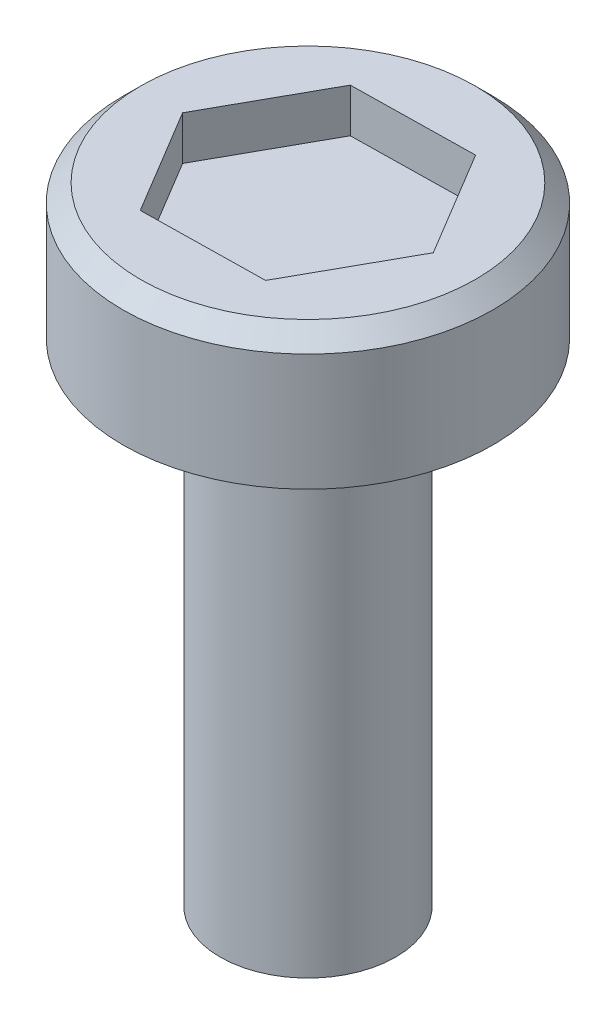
from build123d import *

# Parameters (mm, degrees)
CHAMFER1_SIZE      = 2
CUT_EXTRUDE1_DEPTH = 5


with BuildPart() as part:
    # Sketch1 → Revolve1 (revolve)
    with BuildSketch(Plane.XY, mode=Mode.PRIVATE) as revolve1_sk:
        Polygon((0, 0), (10, 0), (10, 56.053084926), (21.077214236, 56.053084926), (21.077214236, 71.379162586), (0, 71.379162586), align=None)
    revolve(revolve1_sk.sketch.rotate(Axis((0, 71.379162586, 0), (0, -1, 0)), 90), axis=Axis((0, 71.379162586, 0), (0, -1, 0)))

    # Chamfer1
    chamfer1_edges = [part.edges().sort_by_distance(p)[0] for p in [
        (0, 71.379162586, -21.077214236),
    ]]
    chamfer(chamfer1_edges, length=CHAMFER1_SIZE)

    # Sketch2 → Cut-Extrude1 (cut)
    with BuildSketch(Plane(origin=(0, 71.379162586, 0), x_dir=(-1, 0, 0), z_dir=(0, 1, 0))):
        Polygon((-6.818472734, -12.276376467), (7.22241752, -12.043158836), (14.040890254, 0.233217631), (6.818472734, 12.276376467), (-7.22241752, 12.043158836), (-14.040890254, -0.233217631), align=None)
    extrude(amount=-CUT_EXTRUDE1_DEPTH, mode=Mode.SUBTRACT)


solid = part.part
